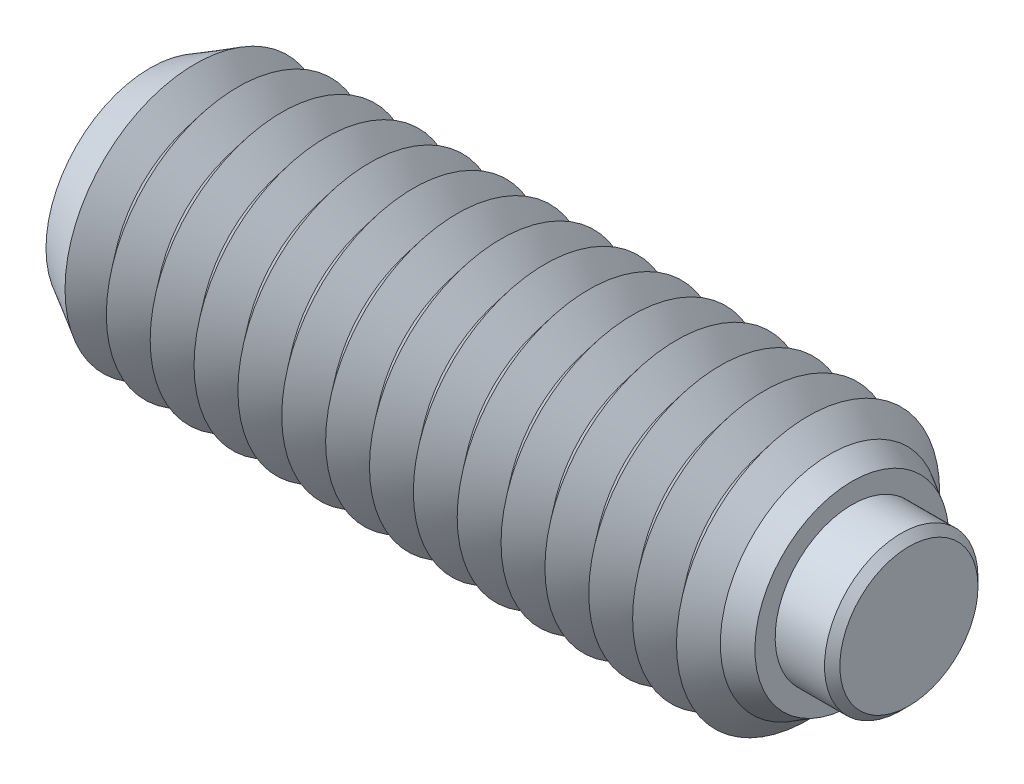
ISO-10303-21;
HEADER;
FILE_DESCRIPTION(('STEP AP214'),'2;1');
FILE_NAME('part.step','',(''),(''),'','','');
FILE_SCHEMA(('AUTOMOTIVE_DESIGN { 1 0 10303 214 1 1 1 1 }'));
ENDSEC;
DATA;
#1=APPLICATION_CONTEXT('core data for automotive mechanical design processes');
#2=APPLICATION_PROTOCOL_DEFINITION('international standard','automotive_design',2000,#1);
#3=PRODUCT_CONTEXT('',#1,'mechanical');
#4=PRODUCT('Part','Part','',(#3));
#5=PRODUCT_RELATED_PRODUCT_CATEGORY('part','',(#4));
#6=PRODUCT_DEFINITION_FORMATION('','',#4);
#7=PRODUCT_DEFINITION_CONTEXT('part definition',#1,'design');
#8=PRODUCT_DEFINITION('design','',#6,#7);
#9=PRODUCT_DEFINITION_SHAPE('','',#8);
#10=(LENGTH_UNIT() NAMED_UNIT(*) SI_UNIT(.MILLI.,.METRE.));
#11=(NAMED_UNIT(*) PLANE_ANGLE_UNIT() SI_UNIT($,.RADIAN.));
#12=(NAMED_UNIT(*) SI_UNIT($,.STERADIAN.) SOLID_ANGLE_UNIT());
#13=UNCERTAINTY_MEASURE_WITH_UNIT(LENGTH_MEASURE(1.E-05),#10,'distance_accuracy_value','');
#14=(GEOMETRIC_REPRESENTATION_CONTEXT(3) GLOBAL_UNCERTAINTY_ASSIGNED_CONTEXT((#13)) GLOBAL_UNIT_ASSIGNED_CONTEXT((#10,
#11,#12)) REPRESENTATION_CONTEXT('',''));
#15=CARTESIAN_POINT('',(0.,0.,0.));
#16=DIRECTION('',(0.,0.,1.));
#17=DIRECTION('',(1.,0.,0.));
#18=AXIS2_PLACEMENT_3D('',#15,#16,#17);
#19=CARTESIAN_POINT('',(1.8,0.,0.));
#20=DIRECTION('',(-1.,0.,0.));
#21=DIRECTION('',(0.,0.,1.));
#22=AXIS2_PLACEMENT_3D('',#19,#20,#21);
#23=CYLINDRICAL_SURFACE('',#22,1.75);
#24=CARTESIAN_POINT('',(1.625,0.,0.));
#25=DIRECTION('',(1.,0.,0.));
#26=DIRECTION('',(0.,0.,-1.));
#27=AXIS2_PLACEMENT_3D('',#24,#25,#26);
#28=CIRCLE('',#27,1.75);
#29=CARTESIAN_POINT('',(1.625,0.,-1.75));
#30=VERTEX_POINT('',#29);
#31=EDGE_CURVE('P0_E10',#30,#30,#28,.F.);
#32=ORIENTED_EDGE('',*,*,#31,.T.);
#33=EDGE_LOOP('',(#32));
#34=FACE_BOUND('',#33,.T.);
#35=CARTESIAN_POINT('',(-0.8,0.,0.));
#36=DIRECTION('',(1.,0.,0.));
#37=DIRECTION('',(0.,0.,-1.));
#38=AXIS2_PLACEMENT_3D('',#35,#36,#37);
#39=CIRCLE('',#38,1.75);
#40=CARTESIAN_POINT('',(-0.8,0.,-1.75));
#41=VERTEX_POINT('',#40);
#42=EDGE_CURVE('P0_E25',#41,#41,#39,.T.);
#43=ORIENTED_EDGE('',*,*,#42,.T.);
#44=EDGE_LOOP('',(#43));
#45=FACE_BOUND('',#44,.T.);
#46=ADVANCED_FACE('P0_F14',(#34,#45),#23,.T.);
#47=CARTESIAN_POINT('',(1.8,0.,0.));
#48=DIRECTION('',(1.,0.,0.));
#49=DIRECTION('',(0.,0.,-1.));
#50=AXIS2_PLACEMENT_3D('',#47,#48,#49);
#51=PLANE('',#50);
#52=CARTESIAN_POINT('',(1.8,0.,0.));
#53=DIRECTION('',(1.,0.,0.));
#54=DIRECTION('',(0.,0.,-1.));
#55=AXIS2_PLACEMENT_3D('',#52,#53,#54);
#56=CIRCLE('',#55,1.575);
#57=CARTESIAN_POINT('',(1.8,0.,-1.575));
#58=VERTEX_POINT('',#57);
#59=EDGE_CURVE('P0_E21',#58,#58,#56,.T.);
#60=ORIENTED_EDGE('',*,*,#59,.T.);
#61=EDGE_LOOP('',(#60));
#62=FACE_BOUND('',#61,.T.);
#63=ADVANCED_FACE('P0_F35',(#62),#51,.T.);
#64=CARTESIAN_POINT('',(-0.8,0.,0.));
#65=DIRECTION('',(1.,0.,0.));
#66=DIRECTION('',(0.,0.,-1.));
#67=AXIS2_PLACEMENT_3D('',#64,#65,#66);
#68=PLANE('',#67);
#69=ORIENTED_EDGE('',*,*,#42,.F.);
#70=EDGE_LOOP('',(#69));
#71=FACE_BOUND('',#70,.T.);
#72=ADVANCED_FACE('P0_F33',(#71),#68,.F.);
#73=CARTESIAN_POINT('',(1.8,0.,0.));
#74=DIRECTION('',(-1.,0.,0.));
#75=DIRECTION('',(0.,0.,1.));
#76=AXIS2_PLACEMENT_3D('',#73,#74,#75);
#77=CONICAL_SURFACE('',#76,1.575,0.785398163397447);
#78=ORIENTED_EDGE('',*,*,#31,.F.);
#79=EDGE_LOOP('',(#78));
#80=FACE_BOUND('',#79,.T.);
#81=ORIENTED_EDGE('',*,*,#59,.F.);
#82=EDGE_LOOP('',(#81));
#83=FACE_BOUND('',#82,.T.);
#84=ADVANCED_FACE('P0_F16',(#80,#83),#77,.T.);
#85=CLOSED_SHELL('',(#46,#63,#72,#84));
#86=MANIFOLD_SOLID_BREP('P0_B1',#85);
#87=CARTESIAN_POINT('',(-14.5,0.,0.));
#88=DIRECTION('',(-1.,0.,0.));
#89=DIRECTION('',(0.,0.,1.));
#90=AXIS2_PLACEMENT_3D('',#87,#88,#89);
#91=CONICAL_SURFACE('',#90,3.,0.895664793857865);
#92=CARTESIAN_POINT('',(-14.,0.,0.));
#93=DIRECTION('',(1.,0.,0.));
#94=DIRECTION('',(0.,0.,-1.));
#95=AXIS2_PLACEMENT_3D('',#92,#93,#94);
#96=CIRCLE('',#95,2.37550020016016);
#97=CARTESIAN_POINT('',(-14.,0.,-2.37550020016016));
#98=VERTEX_POINT('',#97);
#99=EDGE_CURVE('P1_E853',#98,#98,#96,.T.);
#100=ORIENTED_EDGE('',*,*,#99,.F.);
#101=EDGE_LOOP('',(#100));
#102=FACE_BOUND('',#101,.T.);
#103=CARTESIAN_POINT('',(-14.4741837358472,0.,0.));
#104=DIRECTION('',(1.,0.,0.));
#105=DIRECTION('',(0.,0.,-1.));
#106=AXIS2_PLACEMENT_3D('',#103,#104,#105);
#107=CIRCLE('',#106,2.96775549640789);
#108=CARTESIAN_POINT('',(-14.4741837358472,0.,-2.96775549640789));
#109=VERTEX_POINT('',#108);
#110=EDGE_CURVE('P1_E856',#109,#109,#107,.F.);
#111=ORIENTED_EDGE('',*,*,#110,.F.);
#112=EDGE_LOOP('',(#111));
#113=FACE_BOUND('',#112,.T.);
#114=ADVANCED_FACE('P1_F15',(#102,#113),#91,.T.);
#115=CARTESIAN_POINT('',(-1.,0.,0.));
#116=DIRECTION('',(1.,0.,0.));
#117=DIRECTION('',(0.,0.,-1.));
#118=AXIS2_PLACEMENT_3D('',#115,#116,#117);
#119=CONICAL_SURFACE('',#118,2.37550020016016,0.895664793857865);
#120=CARTESIAN_POINT('',(-0.5,0.,0.));
#121=DIRECTION('',(1.,0.,0.));
#122=DIRECTION('',(0.,0.,-1.));
#123=AXIS2_PLACEMENT_3D('',#120,#121,#122);
#124=CIRCLE('',#123,3.);
#125=CARTESIAN_POINT('',(-0.5,0.,-3.));
#126=VERTEX_POINT('',#125);
#127=EDGE_CURVE('P1_E771',#126,#126,#124,.T.);
#128=ORIENTED_EDGE('',*,*,#127,.F.);
#129=EDGE_LOOP('',(#128));
#130=FACE_BOUND('',#129,.T.);
#131=CARTESIAN_POINT('',(-1.,0.,0.));
#132=DIRECTION('',(1.,0.,0.));
#133=DIRECTION('',(0.,0.,-1.));
#134=AXIS2_PLACEMENT_3D('',#131,#132,#133);
#135=CIRCLE('',#134,2.37550020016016);
#136=CARTESIAN_POINT('',(-1.,0.,-2.37550020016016));
#137=VERTEX_POINT('',#136);
#138=EDGE_CURVE('P1_E772',#137,#137,#135,.T.);
#139=ORIENTED_EDGE('',*,*,#138,.T.);
#140=EDGE_LOOP('',(#139));
#141=FACE_BOUND('',#140,.T.);
#142=ADVANCED_FACE('P1_F222',(#130,#141),#119,.T.);
#143=CARTESIAN_POINT('',(-1.5,0.,0.));
#144=DIRECTION('',(-1.,0.,0.));
#145=DIRECTION('',(0.,0.,1.));
#146=AXIS2_PLACEMENT_3D('',#143,#144,#145);
#147=CONICAL_SURFACE('',#146,3.,0.895664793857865);
#148=ORIENTED_EDGE('',*,*,#138,.F.);
#149=EDGE_LOOP('',(#148));
#150=FACE_BOUND('',#149,.T.);
#151=CARTESIAN_POINT('',(-1.5,0.,0.));
#152=DIRECTION('',(1.,0.,0.));
#153=DIRECTION('',(0.,0.,-1.));
#154=AXIS2_PLACEMENT_3D('',#151,#152,#153);
#155=CIRCLE('',#154,3.);
#156=CARTESIAN_POINT('',(-1.5,0.,-3.));
#157=VERTEX_POINT('',#156);
#158=EDGE_CURVE('P1_E776',#157,#157,#155,.T.);
#159=ORIENTED_EDGE('',*,*,#158,.T.);
#160=EDGE_LOOP('',(#159));
#161=FACE_BOUND('',#160,.T.);
#162=ADVANCED_FACE('P1_F227',(#150,#161),#147,.T.);
#163=CARTESIAN_POINT('',(-0.8,0.,0.));
#164=DIRECTION('',(1.,0.,0.));
#165=DIRECTION('',(0.,1.,0.));
#166=AXIS2_PLACEMENT_3D('',#163,#164,#165);
#167=PLANE('',#166);
#168=CARTESIAN_POINT('',(-0.8,0.,0.));
#169=DIRECTION('',(1.,0.,0.));
#170=DIRECTION('',(0.,1.,0.));
#171=AXIS2_PLACEMENT_3D('',#168,#169,#170);
#172=CIRCLE('',#171,1.75);
#173=CARTESIAN_POINT('',(-0.8,1.75,0.));
#174=VERTEX_POINT('',#173);
#175=EDGE_CURVE('P1_E406',#174,#174,#172,.T.);
#176=ORIENTED_EDGE('',*,*,#175,.T.);
#177=EDGE_LOOP('',(#176));
#178=FACE_BOUND('',#177,.T.);
#179=ADVANCED_FACE('P1_F333',(#178),#167,.T.);
#180=CARTESIAN_POINT('',(-0.8,0.,0.));
#181=DIRECTION('',(1.,0.,0.));
#182=DIRECTION('',(0.,1.,0.));
#183=AXIS2_PLACEMENT_3D('',#180,#181,#182);
#184=CYLINDRICAL_SURFACE('',#183,1.75);
#185=ORIENTED_EDGE('',*,*,#175,.F.);
#186=EDGE_LOOP('',(#185));
#187=FACE_BOUND('',#186,.T.);
#188=CARTESIAN_POINT('',(0.5,0.,0.));
#189=DIRECTION('',(1.,0.,0.));
#190=DIRECTION('',(0.,1.,0.));
#191=AXIS2_PLACEMENT_3D('',#188,#189,#190);
#192=CIRCLE('',#191,1.75);
#193=CARTESIAN_POINT('',(0.5,1.75,0.));
#194=VERTEX_POINT('',#193);
#195=EDGE_CURVE('P1_E409',#194,#194,#192,.T.);
#196=ORIENTED_EDGE('',*,*,#195,.T.);
#197=EDGE_LOOP('',(#196));
#198=FACE_BOUND('',#197,.T.);
#199=ADVANCED_FACE('P1_F209',(#187,#198),#184,.F.);
#200=CARTESIAN_POINT('',(0.5,2.21132486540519,0.));
#201=DIRECTION('',(1.,0.,0.));
#202=DIRECTION('',(0.,1.,0.));
#203=AXIS2_PLACEMENT_3D('',#200,#201,#202);
#204=PLANE('',#203);
#205=ORIENTED_EDGE('',*,*,#195,.F.);
#206=EDGE_LOOP('',(#205));
#207=FACE_BOUND('',#206,.T.);
#208=CARTESIAN_POINT('',(0.5,0.,0.));
#209=DIRECTION('',(1.,0.,0.));
#210=DIRECTION('',(0.,1.,0.));
#211=AXIS2_PLACEMENT_3D('',#208,#209,#210);
#212=CIRCLE('',#211,2.21132486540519);
#213=CARTESIAN_POINT('',(0.5,2.21132486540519,0.));
#214=VERTEX_POINT('',#213);
#215=EDGE_CURVE('P1_E121',#214,#214,#212,.T.);
#216=ORIENTED_EDGE('',*,*,#215,.T.);
#217=EDGE_LOOP('',(#216));
#218=FACE_BOUND('',#217,.T.);
#219=ADVANCED_FACE('P1_F206',(#207,#218),#204,.T.);
#220=CARTESIAN_POINT('',(0.5,0.,0.));
#221=DIRECTION('',(-1.,0.,0.));
#222=DIRECTION('',(0.,-1.,0.));
#223=AXIS2_PLACEMENT_3D('',#220,#221,#222);
#224=CONICAL_SURFACE('',#223,2.21132486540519,0.523598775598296);
#225=CARTESIAN_POINT('',(0.,0.,0.));
#226=DIRECTION('',(1.,0.,0.));
#227=DIRECTION('',(0.,0.,-1.));
#228=AXIS2_PLACEMENT_3D('',#225,#226,#227);
#229=CIRCLE('',#228,2.5);
#230=CARTESIAN_POINT('',(0.,0.,-2.5));
#231=VERTEX_POINT('',#230);
#232=EDGE_CURVE('P1_E397',#231,#231,#229,.T.);
#233=ORIENTED_EDGE('',*,*,#232,.T.);
#234=EDGE_LOOP('',(#233));
#235=FACE_BOUND('',#234,.T.);
#236=ORIENTED_EDGE('',*,*,#215,.F.);
#237=EDGE_LOOP('',(#236));
#238=FACE_BOUND('',#237,.T.);
#239=ADVANCED_FACE('P1_F203',(#235,#238),#224,.T.);
#240=CARTESIAN_POINT('',(0.,0.,0.));
#241=DIRECTION('',(-1.,0.,0.));
#242=DIRECTION('',(0.,0.,1.));
#243=AXIS2_PLACEMENT_3D('',#240,#241,#242);
#244=CONICAL_SURFACE('',#243,2.5,0.785398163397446);
#245=ORIENTED_EDGE('',*,*,#127,.T.);
#246=EDGE_LOOP('',(#245));
#247=FACE_BOUND('',#246,.T.);
#248=ORIENTED_EDGE('',*,*,#232,.F.);
#249=EDGE_LOOP('',(#248));
#250=FACE_BOUND('',#249,.T.);
#251=ADVANCED_FACE('P1_F17',(#247,#250),#244,.T.);
#252=CARTESIAN_POINT('',(-2.,0.,0.));
#253=DIRECTION('',(1.,0.,0.));
#254=DIRECTION('',(0.,0.,-1.));
#255=AXIS2_PLACEMENT_3D('',#252,#253,#254);
#256=CONICAL_SURFACE('',#255,2.37550020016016,0.895664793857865);
#257=ORIENTED_EDGE('',*,*,#158,.F.);
#258=EDGE_LOOP('',(#257));
#259=FACE_BOUND('',#258,.T.);
#260=CARTESIAN_POINT('',(-2.,0.,0.));
#261=DIRECTION('',(1.,0.,0.));
#262=DIRECTION('',(0.,0.,-1.));
#263=AXIS2_PLACEMENT_3D('',#260,#261,#262);
#264=CIRCLE('',#263,2.37550020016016);
#265=CARTESIAN_POINT('',(-2.,0.,-2.37550020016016));
#266=VERTEX_POINT('',#265);
#267=EDGE_CURVE('P1_E781',#266,#266,#264,.T.);
#268=ORIENTED_EDGE('',*,*,#267,.T.);
#269=EDGE_LOOP('',(#268));
#270=FACE_BOUND('',#269,.T.);
#271=ADVANCED_FACE('P1_F327',(#259,#270),#256,.T.);
#272=CARTESIAN_POINT('',(-2.5,0.,0.));
#273=DIRECTION('',(-1.,0.,0.));
#274=DIRECTION('',(0.,0.,1.));
#275=AXIS2_PLACEMENT_3D('',#272,#273,#274);
#276=CONICAL_SURFACE('',#275,3.,0.895664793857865);
#277=ORIENTED_EDGE('',*,*,#267,.F.);
#278=EDGE_LOOP('',(#277));
#279=FACE_BOUND('',#278,.T.);
#280=CARTESIAN_POINT('',(-2.5,0.,0.));
#281=DIRECTION('',(1.,0.,0.));
#282=DIRECTION('',(0.,0.,-1.));
#283=AXIS2_PLACEMENT_3D('',#280,#281,#282);
#284=CIRCLE('',#283,3.);
#285=CARTESIAN_POINT('',(-2.5,0.,-3.));
#286=VERTEX_POINT('',#285);
#287=EDGE_CURVE('P1_E784',#286,#286,#284,.T.);
#288=ORIENTED_EDGE('',*,*,#287,.T.);
#289=EDGE_LOOP('',(#288));
#290=FACE_BOUND('',#289,.T.);
#291=ADVANCED_FACE('P1_F323',(#279,#290),#276,.T.);
#292=CARTESIAN_POINT('',(-3.,0.,0.));
#293=DIRECTION('',(1.,0.,0.));
#294=DIRECTION('',(0.,0.,-1.));
#295=AXIS2_PLACEMENT_3D('',#292,#293,#294);
#296=CONICAL_SURFACE('',#295,2.37550020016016,0.895664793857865);
#297=ORIENTED_EDGE('',*,*,#287,.F.);
#298=EDGE_LOOP('',(#297));
#299=FACE_BOUND('',#298,.T.);
#300=CARTESIAN_POINT('',(-3.,0.,0.));
#301=DIRECTION('',(1.,0.,0.));
#302=DIRECTION('',(0.,0.,-1.));
#303=AXIS2_PLACEMENT_3D('',#300,#301,#302);
#304=CIRCLE('',#303,2.37550020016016);
#305=CARTESIAN_POINT('',(-3.,0.,-2.37550020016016));
#306=VERTEX_POINT('',#305);
#307=EDGE_CURVE('P1_E787',#306,#306,#304,.T.);
#308=ORIENTED_EDGE('',*,*,#307,.T.);
#309=EDGE_LOOP('',(#308));
#310=FACE_BOUND('',#309,.T.);
#311=ADVANCED_FACE('P1_F319',(#299,#310),#296,.T.);
#312=CARTESIAN_POINT('',(-3.5,0.,0.));
#313=DIRECTION('',(-1.,0.,0.));
#314=DIRECTION('',(0.,0.,1.));
#315=AXIS2_PLACEMENT_3D('',#312,#313,#314);
#316=CONICAL_SURFACE('',#315,3.,0.895664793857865);
#317=ORIENTED_EDGE('',*,*,#307,.F.);
#318=EDGE_LOOP('',(#317));
#319=FACE_BOUND('',#318,.T.);
#320=CARTESIAN_POINT('',(-3.5,0.,0.));
#321=DIRECTION('',(1.,0.,0.));
#322=DIRECTION('',(0.,0.,-1.));
#323=AXIS2_PLACEMENT_3D('',#320,#321,#322);
#324=CIRCLE('',#323,3.);
#325=CARTESIAN_POINT('',(-3.5,0.,-3.));
#326=VERTEX_POINT('',#325);
#327=EDGE_CURVE('P1_E790',#326,#326,#324,.T.);
#328=ORIENTED_EDGE('',*,*,#327,.T.);
#329=EDGE_LOOP('',(#328));
#330=FACE_BOUND('',#329,.T.);
#331=ADVANCED_FACE('P1_F315',(#319,#330),#316,.T.);
#332=CARTESIAN_POINT('',(-4.,0.,0.));
#333=DIRECTION('',(1.,0.,0.));
#334=DIRECTION('',(0.,0.,-1.));
#335=AXIS2_PLACEMENT_3D('',#332,#333,#334);
#336=CONICAL_SURFACE('',#335,2.37550020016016,0.895664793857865);
#337=ORIENTED_EDGE('',*,*,#327,.F.);
#338=EDGE_LOOP('',(#337));
#339=FACE_BOUND('',#338,.T.);
#340=CARTESIAN_POINT('',(-4.,0.,0.));
#341=DIRECTION('',(1.,0.,0.));
#342=DIRECTION('',(0.,0.,-1.));
#343=AXIS2_PLACEMENT_3D('',#340,#341,#342);
#344=CIRCLE('',#343,2.37550020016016);
#345=CARTESIAN_POINT('',(-4.,0.,-2.37550020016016));
#346=VERTEX_POINT('',#345);
#347=EDGE_CURVE('P1_E793',#346,#346,#344,.T.);
#348=ORIENTED_EDGE('',*,*,#347,.T.);
#349=EDGE_LOOP('',(#348));
#350=FACE_BOUND('',#349,.T.);
#351=ADVANCED_FACE('P1_F311',(#339,#350),#336,.T.);
#352=CARTESIAN_POINT('',(-4.5,0.,0.));
#353=DIRECTION('',(-1.,0.,0.));
#354=DIRECTION('',(0.,0.,1.));
#355=AXIS2_PLACEMENT_3D('',#352,#353,#354);
#356=CONICAL_SURFACE('',#355,3.,0.895664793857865);
#357=ORIENTED_EDGE('',*,*,#347,.F.);
#358=EDGE_LOOP('',(#357));
#359=FACE_BOUND('',#358,.T.);
#360=CARTESIAN_POINT('',(-4.5,0.,0.));
#361=DIRECTION('',(1.,0.,0.));
#362=DIRECTION('',(0.,0.,-1.));
#363=AXIS2_PLACEMENT_3D('',#360,#361,#362);
#364=CIRCLE('',#363,3.);
#365=CARTESIAN_POINT('',(-4.5,0.,-3.));
#366=VERTEX_POINT('',#365);
#367=EDGE_CURVE('P1_E796',#366,#366,#364,.T.);
#368=ORIENTED_EDGE('',*,*,#367,.T.);
#369=EDGE_LOOP('',(#368));
#370=FACE_BOUND('',#369,.T.);
#371=ADVANCED_FACE('P1_F307',(#359,#370),#356,.T.);
#372=CARTESIAN_POINT('',(-5.,0.,0.));
#373=DIRECTION('',(1.,0.,0.));
#374=DIRECTION('',(0.,0.,-1.));
#375=AXIS2_PLACEMENT_3D('',#372,#373,#374);
#376=CONICAL_SURFACE('',#375,2.37550020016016,0.895664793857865);
#377=ORIENTED_EDGE('',*,*,#367,.F.);
#378=EDGE_LOOP('',(#377));
#379=FACE_BOUND('',#378,.T.);
#380=CARTESIAN_POINT('',(-5.,0.,0.));
#381=DIRECTION('',(1.,0.,0.));
#382=DIRECTION('',(0.,0.,-1.));
#383=AXIS2_PLACEMENT_3D('',#380,#381,#382);
#384=CIRCLE('',#383,2.37550020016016);
#385=CARTESIAN_POINT('',(-5.,0.,-2.37550020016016));
#386=VERTEX_POINT('',#385);
#387=EDGE_CURVE('P1_E799',#386,#386,#384,.T.);
#388=ORIENTED_EDGE('',*,*,#387,.T.);
#389=EDGE_LOOP('',(#388));
#390=FACE_BOUND('',#389,.T.);
#391=ADVANCED_FACE('P1_F303',(#379,#390),#376,.T.);
#392=CARTESIAN_POINT('',(-5.5,0.,0.));
#393=DIRECTION('',(-1.,0.,0.));
#394=DIRECTION('',(0.,0.,1.));
#395=AXIS2_PLACEMENT_3D('',#392,#393,#394);
#396=CONICAL_SURFACE('',#395,3.,0.895664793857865);
#397=ORIENTED_EDGE('',*,*,#387,.F.);
#398=EDGE_LOOP('',(#397));
#399=FACE_BOUND('',#398,.T.);
#400=CARTESIAN_POINT('',(-5.5,0.,0.));
#401=DIRECTION('',(1.,0.,0.));
#402=DIRECTION('',(0.,0.,-1.));
#403=AXIS2_PLACEMENT_3D('',#400,#401,#402);
#404=CIRCLE('',#403,3.);
#405=CARTESIAN_POINT('',(-5.5,0.,-3.));
#406=VERTEX_POINT('',#405);
#407=EDGE_CURVE('P1_E802',#406,#406,#404,.T.);
#408=ORIENTED_EDGE('',*,*,#407,.T.);
#409=EDGE_LOOP('',(#408));
#410=FACE_BOUND('',#409,.T.);
#411=ADVANCED_FACE('P1_F299',(#399,#410),#396,.T.);
#412=CARTESIAN_POINT('',(-6.,0.,0.));
#413=DIRECTION('',(1.,0.,0.));
#414=DIRECTION('',(0.,0.,-1.));
#415=AXIS2_PLACEMENT_3D('',#412,#413,#414);
#416=CONICAL_SURFACE('',#415,2.37550020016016,0.895664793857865);
#417=ORIENTED_EDGE('',*,*,#407,.F.);
#418=EDGE_LOOP('',(#417));
#419=FACE_BOUND('',#418,.T.);
#420=CARTESIAN_POINT('',(-6.,0.,0.));
#421=DIRECTION('',(1.,0.,0.));
#422=DIRECTION('',(0.,0.,-1.));
#423=AXIS2_PLACEMENT_3D('',#420,#421,#422);
#424=CIRCLE('',#423,2.37550020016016);
#425=CARTESIAN_POINT('',(-6.,0.,-2.37550020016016));
#426=VERTEX_POINT('',#425);
#427=EDGE_CURVE('P1_E805',#426,#426,#424,.T.);
#428=ORIENTED_EDGE('',*,*,#427,.T.);
#429=EDGE_LOOP('',(#428));
#430=FACE_BOUND('',#429,.T.);
#431=ADVANCED_FACE('P1_F295',(#419,#430),#416,.T.);
#432=CARTESIAN_POINT('',(-6.5,0.,0.));
#433=DIRECTION('',(-1.,0.,0.));
#434=DIRECTION('',(0.,0.,1.));
#435=AXIS2_PLACEMENT_3D('',#432,#433,#434);
#436=CONICAL_SURFACE('',#435,3.,0.895664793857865);
#437=ORIENTED_EDGE('',*,*,#427,.F.);
#438=EDGE_LOOP('',(#437));
#439=FACE_BOUND('',#438,.T.);
#440=CARTESIAN_POINT('',(-6.5,0.,0.));
#441=DIRECTION('',(1.,0.,0.));
#442=DIRECTION('',(0.,0.,-1.));
#443=AXIS2_PLACEMENT_3D('',#440,#441,#442);
#444=CIRCLE('',#443,3.);
#445=CARTESIAN_POINT('',(-6.5,0.,-3.));
#446=VERTEX_POINT('',#445);
#447=EDGE_CURVE('P1_E808',#446,#446,#444,.T.);
#448=ORIENTED_EDGE('',*,*,#447,.T.);
#449=EDGE_LOOP('',(#448));
#450=FACE_BOUND('',#449,.T.);
#451=ADVANCED_FACE('P1_F291',(#439,#450),#436,.T.);
#452=CARTESIAN_POINT('',(-7.,0.,0.));
#453=DIRECTION('',(1.,0.,0.));
#454=DIRECTION('',(0.,0.,-1.));
#455=AXIS2_PLACEMENT_3D('',#452,#453,#454);
#456=CONICAL_SURFACE('',#455,2.37550020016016,0.895664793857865);
#457=ORIENTED_EDGE('',*,*,#447,.F.);
#458=EDGE_LOOP('',(#457));
#459=FACE_BOUND('',#458,.T.);
#460=CARTESIAN_POINT('',(-7.,0.,0.));
#461=DIRECTION('',(1.,0.,0.));
#462=DIRECTION('',(0.,0.,-1.));
#463=AXIS2_PLACEMENT_3D('',#460,#461,#462);
#464=CIRCLE('',#463,2.37550020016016);
#465=CARTESIAN_POINT('',(-7.,0.,-2.37550020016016));
#466=VERTEX_POINT('',#465);
#467=EDGE_CURVE('P1_E811',#466,#466,#464,.T.);
#468=ORIENTED_EDGE('',*,*,#467,.T.);
#469=EDGE_LOOP('',(#468));
#470=FACE_BOUND('',#469,.T.);
#471=ADVANCED_FACE('P1_F287',(#459,#470),#456,.T.);
#472=CARTESIAN_POINT('',(-7.5,0.,0.));
#473=DIRECTION('',(-1.,0.,0.));
#474=DIRECTION('',(0.,0.,1.));
#475=AXIS2_PLACEMENT_3D('',#472,#473,#474);
#476=CONICAL_SURFACE('',#475,3.,0.895664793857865);
#477=ORIENTED_EDGE('',*,*,#467,.F.);
#478=EDGE_LOOP('',(#477));
#479=FACE_BOUND('',#478,.T.);
#480=CARTESIAN_POINT('',(-7.5,0.,0.));
#481=DIRECTION('',(1.,0.,0.));
#482=DIRECTION('',(0.,0.,-1.));
#483=AXIS2_PLACEMENT_3D('',#480,#481,#482);
#484=CIRCLE('',#483,3.);
#485=CARTESIAN_POINT('',(-7.5,0.,-3.));
#486=VERTEX_POINT('',#485);
#487=EDGE_CURVE('P1_E814',#486,#486,#484,.T.);
#488=ORIENTED_EDGE('',*,*,#487,.T.);
#489=EDGE_LOOP('',(#488));
#490=FACE_BOUND('',#489,.T.);
#491=ADVANCED_FACE('P1_F283',(#479,#490),#476,.T.);
#492=CARTESIAN_POINT('',(-8.,0.,0.));
#493=DIRECTION('',(1.,0.,0.));
#494=DIRECTION('',(0.,0.,-1.));
#495=AXIS2_PLACEMENT_3D('',#492,#493,#494);
#496=CONICAL_SURFACE('',#495,2.37550020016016,0.895664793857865);
#497=ORIENTED_EDGE('',*,*,#487,.F.);
#498=EDGE_LOOP('',(#497));
#499=FACE_BOUND('',#498,.T.);
#500=CARTESIAN_POINT('',(-8.,0.,0.));
#501=DIRECTION('',(1.,0.,0.));
#502=DIRECTION('',(0.,0.,-1.));
#503=AXIS2_PLACEMENT_3D('',#500,#501,#502);
#504=CIRCLE('',#503,2.37550020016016);
#505=CARTESIAN_POINT('',(-8.,0.,-2.37550020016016));
#506=VERTEX_POINT('',#505);
#507=EDGE_CURVE('P1_E817',#506,#506,#504,.T.);
#508=ORIENTED_EDGE('',*,*,#507,.T.);
#509=EDGE_LOOP('',(#508));
#510=FACE_BOUND('',#509,.T.);
#511=ADVANCED_FACE('P1_F279',(#499,#510),#496,.T.);
#512=CARTESIAN_POINT('',(-8.5,0.,0.));
#513=DIRECTION('',(-1.,0.,0.));
#514=DIRECTION('',(0.,0.,1.));
#515=AXIS2_PLACEMENT_3D('',#512,#513,#514);
#516=CONICAL_SURFACE('',#515,3.,0.895664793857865);
#517=ORIENTED_EDGE('',*,*,#507,.F.);
#518=EDGE_LOOP('',(#517));
#519=FACE_BOUND('',#518,.T.);
#520=CARTESIAN_POINT('',(-8.5,0.,0.));
#521=DIRECTION('',(1.,0.,0.));
#522=DIRECTION('',(0.,0.,-1.));
#523=AXIS2_PLACEMENT_3D('',#520,#521,#522);
#524=CIRCLE('',#523,3.);
#525=CARTESIAN_POINT('',(-8.5,0.,-3.));
#526=VERTEX_POINT('',#525);
#527=EDGE_CURVE('P1_E820',#526,#526,#524,.T.);
#528=ORIENTED_EDGE('',*,*,#527,.T.);
#529=EDGE_LOOP('',(#528));
#530=FACE_BOUND('',#529,.T.);
#531=ADVANCED_FACE('P1_F275',(#519,#530),#516,.T.);
#532=CARTESIAN_POINT('',(-9.,0.,0.));
#533=DIRECTION('',(1.,0.,0.));
#534=DIRECTION('',(0.,0.,-1.));
#535=AXIS2_PLACEMENT_3D('',#532,#533,#534);
#536=CONICAL_SURFACE('',#535,2.37550020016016,0.895664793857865);
#537=ORIENTED_EDGE('',*,*,#527,.F.);
#538=EDGE_LOOP('',(#537));
#539=FACE_BOUND('',#538,.T.);
#540=CARTESIAN_POINT('',(-9.,0.,0.));
#541=DIRECTION('',(1.,0.,0.));
#542=DIRECTION('',(0.,0.,-1.));
#543=AXIS2_PLACEMENT_3D('',#540,#541,#542);
#544=CIRCLE('',#543,2.37550020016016);
#545=CARTESIAN_POINT('',(-9.,0.,-2.37550020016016));
#546=VERTEX_POINT('',#545);
#547=EDGE_CURVE('P1_E823',#546,#546,#544,.T.);
#548=ORIENTED_EDGE('',*,*,#547,.T.);
#549=EDGE_LOOP('',(#548));
#550=FACE_BOUND('',#549,.T.);
#551=ADVANCED_FACE('P1_F271',(#539,#550),#536,.T.);
#552=CARTESIAN_POINT('',(-9.5,0.,0.));
#553=DIRECTION('',(-1.,0.,0.));
#554=DIRECTION('',(0.,0.,1.));
#555=AXIS2_PLACEMENT_3D('',#552,#553,#554);
#556=CONICAL_SURFACE('',#555,3.,0.895664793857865);
#557=ORIENTED_EDGE('',*,*,#547,.F.);
#558=EDGE_LOOP('',(#557));
#559=FACE_BOUND('',#558,.T.);
#560=CARTESIAN_POINT('',(-9.5,0.,0.));
#561=DIRECTION('',(1.,0.,0.));
#562=DIRECTION('',(0.,0.,-1.));
#563=AXIS2_PLACEMENT_3D('',#560,#561,#562);
#564=CIRCLE('',#563,3.);
#565=CARTESIAN_POINT('',(-9.5,0.,-3.));
#566=VERTEX_POINT('',#565);
#567=EDGE_CURVE('P1_E826',#566,#566,#564,.T.);
#568=ORIENTED_EDGE('',*,*,#567,.T.);
#569=EDGE_LOOP('',(#568));
#570=FACE_BOUND('',#569,.T.);
#571=ADVANCED_FACE('P1_F267',(#559,#570),#556,.T.);
#572=CARTESIAN_POINT('',(-10.,0.,0.));
#573=DIRECTION('',(1.,0.,0.));
#574=DIRECTION('',(0.,0.,-1.));
#575=AXIS2_PLACEMENT_3D('',#572,#573,#574);
#576=CONICAL_SURFACE('',#575,2.37550020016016,0.895664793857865);
#577=ORIENTED_EDGE('',*,*,#567,.F.);
#578=EDGE_LOOP('',(#577));
#579=FACE_BOUND('',#578,.T.);
#580=CARTESIAN_POINT('',(-10.,0.,0.));
#581=DIRECTION('',(1.,0.,0.));
#582=DIRECTION('',(0.,0.,-1.));
#583=AXIS2_PLACEMENT_3D('',#580,#581,#582);
#584=CIRCLE('',#583,2.37550020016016);
#585=CARTESIAN_POINT('',(-10.,0.,-2.37550020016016));
#586=VERTEX_POINT('',#585);
#587=EDGE_CURVE('P1_E829',#586,#586,#584,.T.);
#588=ORIENTED_EDGE('',*,*,#587,.T.);
#589=EDGE_LOOP('',(#588));
#590=FACE_BOUND('',#589,.T.);
#591=ADVANCED_FACE('P1_F263',(#579,#590),#576,.T.);
#592=CARTESIAN_POINT('',(-10.5,0.,0.));
#593=DIRECTION('',(-1.,0.,0.));
#594=DIRECTION('',(0.,0.,1.));
#595=AXIS2_PLACEMENT_3D('',#592,#593,#594);
#596=CONICAL_SURFACE('',#595,3.,0.895664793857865);
#597=ORIENTED_EDGE('',*,*,#587,.F.);
#598=EDGE_LOOP('',(#597));
#599=FACE_BOUND('',#598,.T.);
#600=CARTESIAN_POINT('',(-10.5,0.,0.));
#601=DIRECTION('',(1.,0.,0.));
#602=DIRECTION('',(0.,0.,-1.));
#603=AXIS2_PLACEMENT_3D('',#600,#601,#602);
#604=CIRCLE('',#603,3.);
#605=CARTESIAN_POINT('',(-10.5,0.,-3.));
#606=VERTEX_POINT('',#605);
#607=EDGE_CURVE('P1_E832',#606,#606,#604,.T.);
#608=ORIENTED_EDGE('',*,*,#607,.T.);
#609=EDGE_LOOP('',(#608));
#610=FACE_BOUND('',#609,.T.);
#611=ADVANCED_FACE('P1_F259',(#599,#610),#596,.T.);
#612=CARTESIAN_POINT('',(-11.,0.,0.));
#613=DIRECTION('',(1.,0.,0.));
#614=DIRECTION('',(0.,0.,-1.));
#615=AXIS2_PLACEMENT_3D('',#612,#613,#614);
#616=CONICAL_SURFACE('',#615,2.37550020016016,0.895664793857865);
#617=ORIENTED_EDGE('',*,*,#607,.F.);
#618=EDGE_LOOP('',(#617));
#619=FACE_BOUND('',#618,.T.);
#620=CARTESIAN_POINT('',(-11.,0.,0.));
#621=DIRECTION('',(1.,0.,0.));
#622=DIRECTION('',(0.,0.,-1.));
#623=AXIS2_PLACEMENT_3D('',#620,#621,#622);
#624=CIRCLE('',#623,2.37550020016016);
#625=CARTESIAN_POINT('',(-11.,0.,-2.37550020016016));
#626=VERTEX_POINT('',#625);
#627=EDGE_CURVE('P1_E835',#626,#626,#624,.T.);
#628=ORIENTED_EDGE('',*,*,#627,.T.);
#629=EDGE_LOOP('',(#628));
#630=FACE_BOUND('',#629,.T.);
#631=ADVANCED_FACE('P1_F255',(#619,#630),#616,.T.);
#632=CARTESIAN_POINT('',(-11.5,0.,0.));
#633=DIRECTION('',(-1.,0.,0.));
#634=DIRECTION('',(0.,0.,1.));
#635=AXIS2_PLACEMENT_3D('',#632,#633,#634);
#636=CONICAL_SURFACE('',#635,3.,0.895664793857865);
#637=ORIENTED_EDGE('',*,*,#627,.F.);
#638=EDGE_LOOP('',(#637));
#639=FACE_BOUND('',#638,.T.);
#640=CARTESIAN_POINT('',(-11.5,0.,0.));
#641=DIRECTION('',(1.,0.,0.));
#642=DIRECTION('',(0.,0.,-1.));
#643=AXIS2_PLACEMENT_3D('',#640,#641,#642);
#644=CIRCLE('',#643,3.);
#645=CARTESIAN_POINT('',(-11.5,0.,-3.));
#646=VERTEX_POINT('',#645);
#647=EDGE_CURVE('P1_E838',#646,#646,#644,.T.);
#648=ORIENTED_EDGE('',*,*,#647,.T.);
#649=EDGE_LOOP('',(#648));
#650=FACE_BOUND('',#649,.T.);
#651=ADVANCED_FACE('P1_F251',(#639,#650),#636,.T.);
#652=CARTESIAN_POINT('',(-12.,0.,0.));
#653=DIRECTION('',(1.,0.,0.));
#654=DIRECTION('',(0.,0.,-1.));
#655=AXIS2_PLACEMENT_3D('',#652,#653,#654);
#656=CONICAL_SURFACE('',#655,2.37550020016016,0.895664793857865);
#657=ORIENTED_EDGE('',*,*,#647,.F.);
#658=EDGE_LOOP('',(#657));
#659=FACE_BOUND('',#658,.T.);
#660=CARTESIAN_POINT('',(-12.,0.,0.));
#661=DIRECTION('',(1.,0.,0.));
#662=DIRECTION('',(0.,0.,-1.));
#663=AXIS2_PLACEMENT_3D('',#660,#661,#662);
#664=CIRCLE('',#663,2.37550020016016);
#665=CARTESIAN_POINT('',(-12.,0.,-2.37550020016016));
#666=VERTEX_POINT('',#665);
#667=EDGE_CURVE('P1_E841',#666,#666,#664,.T.);
#668=ORIENTED_EDGE('',*,*,#667,.T.);
#669=EDGE_LOOP('',(#668));
#670=FACE_BOUND('',#669,.T.);
#671=ADVANCED_FACE('P1_F247',(#659,#670),#656,.T.);
#672=CARTESIAN_POINT('',(-12.5,0.,0.));
#673=DIRECTION('',(-1.,0.,0.));
#674=DIRECTION('',(0.,0.,1.));
#675=AXIS2_PLACEMENT_3D('',#672,#673,#674);
#676=CONICAL_SURFACE('',#675,3.,0.895664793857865);
#677=ORIENTED_EDGE('',*,*,#667,.F.);
#678=EDGE_LOOP('',(#677));
#679=FACE_BOUND('',#678,.T.);
#680=CARTESIAN_POINT('',(-12.5,0.,0.));
#681=DIRECTION('',(1.,0.,0.));
#682=DIRECTION('',(0.,0.,-1.));
#683=AXIS2_PLACEMENT_3D('',#680,#681,#682);
#684=CIRCLE('',#683,3.);
#685=CARTESIAN_POINT('',(-12.5,0.,-3.));
#686=VERTEX_POINT('',#685);
#687=EDGE_CURVE('P1_E844',#686,#686,#684,.T.);
#688=ORIENTED_EDGE('',*,*,#687,.T.);
#689=EDGE_LOOP('',(#688));
#690=FACE_BOUND('',#689,.T.);
#691=ADVANCED_FACE('P1_F243',(#679,#690),#676,.T.);
#692=CARTESIAN_POINT('',(-13.,0.,0.));
#693=DIRECTION('',(1.,0.,0.));
#694=DIRECTION('',(0.,0.,-1.));
#695=AXIS2_PLACEMENT_3D('',#692,#693,#694);
#696=CONICAL_SURFACE('',#695,2.37550020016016,0.895664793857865);
#697=ORIENTED_EDGE('',*,*,#687,.F.);
#698=EDGE_LOOP('',(#697));
#699=FACE_BOUND('',#698,.T.);
#700=CARTESIAN_POINT('',(-13.,0.,0.));
#701=DIRECTION('',(1.,0.,0.));
#702=DIRECTION('',(0.,0.,-1.));
#703=AXIS2_PLACEMENT_3D('',#700,#701,#702);
#704=CIRCLE('',#703,2.37550020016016);
#705=CARTESIAN_POINT('',(-13.,0.,-2.37550020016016));
#706=VERTEX_POINT('',#705);
#707=EDGE_CURVE('P1_E847',#706,#706,#704,.T.);
#708=ORIENTED_EDGE('',*,*,#707,.T.);
#709=EDGE_LOOP('',(#708));
#710=FACE_BOUND('',#709,.T.);
#711=ADVANCED_FACE('P1_F239',(#699,#710),#696,.T.);
#712=CARTESIAN_POINT('',(-13.5,0.,0.));
#713=DIRECTION('',(-1.,0.,0.));
#714=DIRECTION('',(0.,0.,1.));
#715=AXIS2_PLACEMENT_3D('',#712,#713,#714);
#716=CONICAL_SURFACE('',#715,3.,0.895664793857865);
#717=ORIENTED_EDGE('',*,*,#707,.F.);
#718=EDGE_LOOP('',(#717));
#719=FACE_BOUND('',#718,.T.);
#720=CARTESIAN_POINT('',(-13.5,0.,0.));
#721=DIRECTION('',(1.,0.,0.));
#722=DIRECTION('',(0.,0.,-1.));
#723=AXIS2_PLACEMENT_3D('',#720,#721,#722);
#724=CIRCLE('',#723,3.);
#725=CARTESIAN_POINT('',(-13.5,0.,-3.));
#726=VERTEX_POINT('',#725);
#727=EDGE_CURVE('P1_E850',#726,#726,#724,.T.);
#728=ORIENTED_EDGE('',*,*,#727,.T.);
#729=EDGE_LOOP('',(#728));
#730=FACE_BOUND('',#729,.T.);
#731=ADVANCED_FACE('P1_F235',(#719,#730),#716,.T.);
#732=CARTESIAN_POINT('',(-14.,0.,0.));
#733=DIRECTION('',(1.,0.,0.));
#734=DIRECTION('',(0.,0.,-1.));
#735=AXIS2_PLACEMENT_3D('',#732,#733,#734);
#736=CONICAL_SURFACE('',#735,2.37550020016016,0.895664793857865);
#737=ORIENTED_EDGE('',*,*,#727,.F.);
#738=EDGE_LOOP('',(#737));
#739=FACE_BOUND('',#738,.T.);
#740=ORIENTED_EDGE('',*,*,#99,.T.);
#741=EDGE_LOOP('',(#740));
#742=FACE_BOUND('',#741,.T.);
#743=ADVANCED_FACE('P1_F219',(#739,#742),#736,.T.);
#744=CARTESIAN_POINT('',(-15.5,0.,0.));
#745=DIRECTION('',(1.,0.,0.));
#746=DIRECTION('',(0.,0.,1.));
#747=AXIS2_PLACEMENT_3D('',#744,#745,#746);
#748=CONICAL_SURFACE('',#747,2.37550020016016,0.5235987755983);
#749=CARTESIAN_POINT('',(-15.5,0.,0.));
#750=DIRECTION('',(-1.,0.,0.));
#751=DIRECTION('',(0.,0.,1.));
#752=AXIS2_PLACEMENT_3D('',#749,#750,#751);
#753=CIRCLE('',#752,2.37550020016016);
#754=CARTESIAN_POINT('',(-15.5,0.,2.37550020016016));
#755=VERTEX_POINT('',#754);
#756=EDGE_CURVE('P1_E858',#755,#755,#753,.T.);
#757=ORIENTED_EDGE('',*,*,#756,.F.);
#758=EDGE_LOOP('',(#757));
#759=FACE_BOUND('',#758,.T.);
#760=ORIENTED_EDGE('',*,*,#110,.T.);
#761=EDGE_LOOP('',(#760));
#762=FACE_BOUND('',#761,.T.);
#763=ADVANCED_FACE('P1_F159',(#759,#762),#748,.T.);
#764=CARTESIAN_POINT('',(-15.5,0.,0.));
#765=DIRECTION('',(1.,0.,0.));
#766=DIRECTION('',(0.,0.,-1.));
#767=AXIS2_PLACEMENT_3D('',#764,#765,#766);
#768=PLANE('',#767);
#769=CARTESIAN_POINT('',(-15.5,0.,0.));
#770=DIRECTION('',(1.,0.,0.));
#771=DIRECTION('',(0.,0.,-1.));
#772=AXIS2_PLACEMENT_3D('',#769,#770,#771);
#773=CIRCLE('',#772,1.73205080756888);
#774=CARTESIAN_POINT('',(-15.5,-1.5,-0.866025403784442));
#775=VERTEX_POINT('',#774);
#776=CARTESIAN_POINT('',(-15.5,0.,-1.73205080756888));
#777=VERTEX_POINT('',#776);
#778=EDGE_CURVE('P1_E19',#775,#777,#773,.T.);
#779=ORIENTED_EDGE('',*,*,#778,.T.);
#780=CARTESIAN_POINT('',(-15.5,1.5,-0.866025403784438));
#781=VERTEX_POINT('',#780);
#782=EDGE_CURVE('P1_E10',#777,#781,#773,.T.);
#783=ORIENTED_EDGE('',*,*,#782,.T.);
#784=CARTESIAN_POINT('',(-15.5,1.5,0.866025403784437));
#785=VERTEX_POINT('',#784);
#786=EDGE_CURVE('P1_E24',#781,#785,#773,.T.);
#787=ORIENTED_EDGE('',*,*,#786,.T.);
#788=CARTESIAN_POINT('',(-15.5,0.,0.));
#789=DIRECTION('',(-1.,0.,0.));
#790=DIRECTION('',(0.,0.,1.));
#791=AXIS2_PLACEMENT_3D('',#788,#789,#790);
#792=CIRCLE('',#791,1.73205080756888);
#793=CARTESIAN_POINT('',(-15.5,0.,1.73205080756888));
#794=VERTEX_POINT('',#793);
#795=EDGE_CURVE('P1_E92',#794,#785,#792,.T.);
#796=ORIENTED_EDGE('',*,*,#795,.F.);
#797=CARTESIAN_POINT('',(-15.5,-1.5,0.86602540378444));
#798=VERTEX_POINT('',#797);
#799=EDGE_CURVE('P1_E101',#794,#798,#773,.T.);
#800=ORIENTED_EDGE('',*,*,#799,.T.);
#801=EDGE_CURVE('P1_E107',#798,#775,#773,.T.);
#802=ORIENTED_EDGE('',*,*,#801,.T.);
#803=EDGE_LOOP('',(#779,#783,#787,#796,#800,#802));
#804=FACE_BOUND('',#803,.T.);
#805=ORIENTED_EDGE('',*,*,#756,.T.);
#806=EDGE_LOOP('',(#805));
#807=FACE_BOUND('',#806,.T.);
#808=ADVANCED_FACE('P1_F108',(#804,#807),#768,.F.);
#809=CARTESIAN_POINT('',(-15.5,0.,0.));
#810=DIRECTION('',(-1.,0.,0.));
#811=DIRECTION('',(0.,0.,1.));
#812=AXIS2_PLACEMENT_3D('',#809,#810,#811);
#813=CONICAL_SURFACE('',#812,1.73205080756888,1.0471975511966);
#814=ORIENTED_EDGE('',*,*,#778,.F.);
#815=CARTESIAN_POINT('',(-15.5000666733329,0.000199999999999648,-1.73216627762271));
#816=CARTESIAN_POINT('',(-15.4780828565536,-0.0657192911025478,-1.69410775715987));
#817=CARTESIAN_POINT('',(-15.4580888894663,-0.132207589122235,-1.65572072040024));
#818=CARTESIAN_POINT('',(-15.4231881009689,-0.26633566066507,-1.5782818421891));
#819=CARTESIAN_POINT('',(-15.4082936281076,-0.333977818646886,-1.53922862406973));
#820=CARTESIAN_POINT('',(-15.3851066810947,-0.468423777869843,-1.4616062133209));
#821=CARTESIAN_POINT('',(-15.3766599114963,-0.535206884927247,-1.42304896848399));
#822=CARTESIAN_POINT('',(-15.3665735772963,-0.66908756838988,-1.34575291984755));
#823=CARTESIAN_POINT('',(-15.3649256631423,-0.736184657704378,-1.30701439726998));
#824=CARTESIAN_POINT('',(-15.3683416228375,-0.861574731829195,-1.23462040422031));
#825=CARTESIAN_POINT('',(-15.3725667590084,-0.919886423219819,-1.20095413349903));
#826=CARTESIAN_POINT('',(-15.3859617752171,-1.03612987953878,-1.13384094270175));
#827=CARTESIAN_POINT('',(-15.3951362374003,-1.09406124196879,-1.10039425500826));
#828=CARTESIAN_POINT('',(-15.4180731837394,-1.21054465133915,-1.03314252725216));
#829=CARTESIAN_POINT('',(-15.4319329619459,-1.26908194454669,-0.99934600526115));
#830=CARTESIAN_POINT('',(-15.4633897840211,-1.38528312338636,-0.932257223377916));
#831=CARTESIAN_POINT('',(-15.4809794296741,-1.44294849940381,-0.89896410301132));
#832=CARTESIAN_POINT('',(-15.5000666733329,-1.5002,-0.8659099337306));
#833=B_SPLINE_CURVE_WITH_KNOTS('',3,(#815,#816,#817,#818,#819,#820,#821,#822,#823,#824,#825,
#826,#827,#828,#829,#830,#831,#832),.UNSPECIFIED.,.F.,.F.,(4,2,2,2,2,2,2,2,4),(0.,
0.237777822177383,0.476127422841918,0.708577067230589,0.940741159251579,1.1429435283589,
1.34533342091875,1.55221450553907,1.75868901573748),.UNSPECIFIED.);
#834=EDGE_CURVE('P1_E130',#777,#775,#833,.T.);
#835=ORIENTED_EDGE('',*,*,#834,.F.);
#836=EDGE_LOOP('',(#814,#835));
#837=FACE_BOUND('',#836,.T.);
#838=ADVANCED_FACE('P1_F158',(#837),#813,.F.);
#839=ORIENTED_EDGE('',*,*,#801,.F.);
#840=CARTESIAN_POINT('',(-16.0577529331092,-1.5,-2.2427176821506));
#841=CARTESIAN_POINT('',(-16.0266762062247,-1.5,-2.17794242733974));
#842=CARTESIAN_POINT('',(-15.995922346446,-1.5,-2.11300950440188));
#843=CARTESIAN_POINT('',(-15.9352433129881,-1.5,-1.98274395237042));
#844=CARTESIAN_POINT('',(-15.9053182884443,-1.5,-1.91741125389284));
#845=CARTESIAN_POINT('',(-15.846312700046,-1.5,-1.78588718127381));
#846=CARTESIAN_POINT('',(-15.8172383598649,-1.5,-1.71969300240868));
#847=CARTESIAN_POINT('',(-15.7603940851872,-1.5,-1.58675026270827));
#848=CARTESIAN_POINT('',(-15.7326240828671,-1.5,-1.52000173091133));
#849=CARTESIAN_POINT('',(-15.6780255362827,-1.5,-1.38408099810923));
#850=CARTESIAN_POINT('',(-15.6512405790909,-1.5,-1.3148910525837));
#851=CARTESIAN_POINT('',(-15.5999065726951,-1.5,-1.17568930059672));
#852=CARTESIAN_POINT('',(-15.5753578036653,-1.5,-1.10567739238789));
#853=CARTESIAN_POINT('',(-15.5061010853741,-1.5,-0.894522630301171));
#854=CARTESIAN_POINT('',(-15.4656202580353,-1.5,-0.751874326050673));
#855=CARTESIAN_POINT('',(-15.4186644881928,-1.5,-0.535047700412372));
#856=CARTESIAN_POINT('',(-15.4053128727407,-1.5,-0.46236564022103));
#857=CARTESIAN_POINT('',(-15.3841134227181,-1.5,-0.316183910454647));
#858=CARTESIAN_POINT('',(-15.3762652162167,-1.5,-0.242684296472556));
#859=CARTESIAN_POINT('',(-15.3667985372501,-1.5,-0.0961589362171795));
#860=CARTESIAN_POINT('',(-15.3651065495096,-1.5,-0.0231380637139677));
#861=CARTESIAN_POINT('',(-15.3678994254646,-1.5,0.122783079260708));
#862=CARTESIAN_POINT('',(-15.3723846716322,-1.5,0.195683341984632));
#863=CARTESIAN_POINT('',(-15.3906776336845,-1.5,0.375553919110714));
#864=CARTESIAN_POINT('',(-15.4079134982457,-1.5,0.482175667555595));
#865=CARTESIAN_POINT('',(-15.4523598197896,-1.5,0.693345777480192));
#866=CARTESIAN_POINT('',(-15.4795822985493,-1.5,0.797891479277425));
#867=CARTESIAN_POINT('',(-15.5260849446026,-1.5,0.954251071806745));
#868=CARTESIAN_POINT('',(-15.5427475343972,-1.5,1.00687320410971));
#869=CARTESIAN_POINT('',(-15.5776140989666,-1.5,1.11156970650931));
#870=CARTESIAN_POINT('',(-15.595817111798,-1.5,1.16364439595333));
#871=CARTESIAN_POINT('',(-15.6335001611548,-1.5,1.26731560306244));
#872=CARTESIAN_POINT('',(-15.6529799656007,-1.5,1.31891220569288));
#873=CARTESIAN_POINT('',(-15.6930058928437,-1.5,1.42169884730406));
#874=CARTESIAN_POINT('',(-15.7135521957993,-1.5,1.47288881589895));
#875=CARTESIAN_POINT('',(-15.7673136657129,-1.5,1.60355339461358));
#876=CARTESIAN_POINT('',(-15.8011631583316,-1.5,1.68276673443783));
#877=CARTESIAN_POINT('',(-15.8704938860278,-1.5,1.84047808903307));
#878=CARTESIAN_POINT('',(-15.905975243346,-1.5,1.91897604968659));
#879=CARTESIAN_POINT('',(-16.0142918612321,-1.5,2.15363522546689));
#880=CARTESIAN_POINT('',(-16.0889885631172,-1.5,2.3089355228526));
#881=CARTESIAN_POINT('',(-16.2415147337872,-1.5,2.61820933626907));
#882=CARTESIAN_POINT('',(-16.3193479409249,-1.5,2.77218098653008));
#883=CARTESIAN_POINT('',(-16.4770156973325,-1.5,3.07906936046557));
#884=CARTESIAN_POINT('',(-16.5568499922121,-1.5,3.23198621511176));
#885=CARTESIAN_POINT('',(-16.7102968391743,-1.5,3.52269097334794));
#886=CARTESIAN_POINT('',(-16.7837854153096,-1.5,3.66054454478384));
#887=CARTESIAN_POINT('',(-16.9315998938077,-1.5,3.93580825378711));
#888=CARTESIAN_POINT('',(-17.0059258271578,-1.5,4.07321837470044));
#889=CARTESIAN_POINT('',(-17.1550151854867,-1.5,4.34734790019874));
#890=CARTESIAN_POINT('',(-17.2297770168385,-1.5,4.48406817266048));
#891=CARTESIAN_POINT('',(-17.3797872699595,-1.5,4.75723230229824));
#892=CARTESIAN_POINT('',(-17.4550356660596,-1.5,4.89367617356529));
#893=CARTESIAN_POINT('',(-17.53046248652,-1.5,5.03002074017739));
#894=B_SPLINE_CURVE_WITH_KNOTS('',3,(#840,#841,#842,#843,#844,#845,#846,#847,#848,#849,#850,
#851,#852,#853,#854,#855,#856,#857,#858,#859,#860,#861,#862,#863,#864,#865,#866,#867,#868,#869,
#870,#871,#872,#873,#874,#875,#876,#877,#878,#879,#880,#881,#882,#883,#884,#885,#886,#887,#888,
#889,#890,#891,#892,#893),.UNSPECIFIED.,.F.,.F.,(4,2,2,2,2,2,2,2,2,2,2,2,2,2,2,2,2,2,2,2,2,2,2,
2,2,2,4),(0.,0.215535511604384,0.431109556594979,0.647991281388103,0.864861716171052,
1.08740133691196,1.30996880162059,1.75384817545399,1.97537465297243,2.19688615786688,
2.41574360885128,2.63461461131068,2.95796757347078,3.28171106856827,3.44728442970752,
3.61275514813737,3.77819587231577,3.94366463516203,4.20206568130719,4.46048611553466,
4.97741233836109,5.49497404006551,6.01247027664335,6.48112210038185,6.94979132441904,
7.41726847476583,7.88472116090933),.UNSPECIFIED.);
#895=EDGE_CURVE('P1_E128',#775,#798,#894,.T.);
#896=ORIENTED_EDGE('',*,*,#895,.F.);
#897=EDGE_LOOP('',(#839,#896));
#898=FACE_BOUND('',#897,.T.);
#899=ADVANCED_FACE('P1_F217',(#898),#813,.F.);
#900=ORIENTED_EDGE('',*,*,#799,.F.);
#901=CARTESIAN_POINT('',(-15.5000666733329,-1.5002,0.865909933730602));
#902=CARTESIAN_POINT('',(-15.4780828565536,-1.43428070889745,0.903968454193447));
#903=CARTESIAN_POINT('',(-15.4580888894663,-1.36779241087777,0.942355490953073));
#904=CARTESIAN_POINT('',(-15.4231881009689,-1.23366433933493,1.01979436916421));
#905=CARTESIAN_POINT('',(-15.4082936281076,-1.16602218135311,1.05884758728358));
#906=CARTESIAN_POINT('',(-15.3851066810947,-1.03157622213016,1.13646999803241));
#907=CARTESIAN_POINT('',(-15.3766599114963,-0.964793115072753,1.17502724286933));
#908=CARTESIAN_POINT('',(-15.3665735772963,-0.83091243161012,1.25232329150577));
#909=CARTESIAN_POINT('',(-15.3649256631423,-0.763815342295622,1.29106181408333));
#910=CARTESIAN_POINT('',(-15.3683416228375,-0.638425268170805,1.363455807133));
#911=CARTESIAN_POINT('',(-15.3725667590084,-0.580113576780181,1.39712207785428));
#912=CARTESIAN_POINT('',(-15.3859617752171,-0.463870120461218,1.46423526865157));
#913=CARTESIAN_POINT('',(-15.3951362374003,-0.405938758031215,1.49768195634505));
#914=CARTESIAN_POINT('',(-15.4180731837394,-0.289455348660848,1.56493368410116));
#915=CARTESIAN_POINT('',(-15.4319329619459,-0.230918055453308,1.59873020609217));
#916=CARTESIAN_POINT('',(-15.4633897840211,-0.11471687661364,1.6658189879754));
#917=CARTESIAN_POINT('',(-15.4809794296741,-0.0570515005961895,1.699112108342));
#918=CARTESIAN_POINT('',(-15.5000666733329,0.000199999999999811,1.73216627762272));
#919=B_SPLINE_CURVE_WITH_KNOTS('',3,(#901,#902,#903,#904,#905,#906,#907,#908,#909,#910,#911,
#912,#913,#914,#915,#916,#917,#918),.UNSPECIFIED.,.F.,.F.,(4,2,2,2,2,2,2,2,4),(0.,
0.237777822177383,0.476127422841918,0.708577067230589,0.940741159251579,1.1429435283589,
1.34533342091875,1.55221450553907,1.75868901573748),.UNSPECIFIED.);
#920=EDGE_CURVE('P1_E96',#798,#794,#919,.T.);
#921=ORIENTED_EDGE('',*,*,#920,.F.);
#922=EDGE_LOOP('',(#900,#921));
#923=FACE_BOUND('',#922,.T.);
#924=ADVANCED_FACE('P1_F102',(#923),#813,.F.);
#925=ORIENTED_EDGE('',*,*,#795,.T.);
#926=CARTESIAN_POINT('',(-15.5000666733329,-0.000200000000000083,1.73216627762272));
#927=CARTESIAN_POINT('',(-15.4780828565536,0.0657192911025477,1.69410775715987));
#928=CARTESIAN_POINT('',(-15.4580888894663,0.132207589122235,1.65572072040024));
#929=CARTESIAN_POINT('',(-15.4231881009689,0.26633566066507,1.5782818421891));
#930=CARTESIAN_POINT('',(-15.4082936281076,0.333977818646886,1.53922862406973));
#931=CARTESIAN_POINT('',(-15.3851066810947,0.468423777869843,1.4616062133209));
#932=CARTESIAN_POINT('',(-15.3766599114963,0.535206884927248,1.42304896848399));
#933=CARTESIAN_POINT('',(-15.3665735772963,0.669087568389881,1.34575291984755));
#934=CARTESIAN_POINT('',(-15.3649256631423,0.736184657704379,1.30701439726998));
#935=CARTESIAN_POINT('',(-15.3683416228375,0.861574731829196,1.23462040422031));
#936=CARTESIAN_POINT('',(-15.3725667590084,0.91988642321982,1.20095413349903));
#937=CARTESIAN_POINT('',(-15.3859617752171,1.03612987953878,1.13384094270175));
#938=CARTESIAN_POINT('',(-15.3951362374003,1.09406124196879,1.10039425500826));
#939=CARTESIAN_POINT('',(-15.4180731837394,1.21054465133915,1.03314252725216));
#940=CARTESIAN_POINT('',(-15.4319329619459,1.26908194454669,0.999346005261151));
#941=CARTESIAN_POINT('',(-15.4633897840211,1.38528312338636,0.932257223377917));
#942=CARTESIAN_POINT('',(-15.4809794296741,1.44294849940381,0.898964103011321));
#943=CARTESIAN_POINT('',(-15.5000666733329,1.5002,0.865909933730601));
#944=B_SPLINE_CURVE_WITH_KNOTS('',3,(#926,#927,#928,#929,#930,#931,#932,#933,#934,#935,#936,
#937,#938,#939,#940,#941,#942,#943),.UNSPECIFIED.,.F.,.F.,(4,2,2,2,2,2,2,2,4),(0.,
0.237777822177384,0.476127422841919,0.70857706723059,0.940741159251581,1.14294352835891,
1.34533342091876,1.55221450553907,1.75868901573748),.UNSPECIFIED.);
#945=EDGE_CURVE('P1_E88',#794,#785,#944,.T.);
#946=ORIENTED_EDGE('',*,*,#945,.F.);
#947=EDGE_LOOP('',(#925,#946));
#948=FACE_BOUND('',#947,.T.);
#949=ADVANCED_FACE('P1_F90',(#948),#813,.F.);
#950=ORIENTED_EDGE('',*,*,#786,.F.);
#951=CARTESIAN_POINT('',(-16.0577529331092,1.5,-2.2427176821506));
#952=CARTESIAN_POINT('',(-16.0266762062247,1.5,-2.17794242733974));
#953=CARTESIAN_POINT('',(-15.995922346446,1.5,-2.11300950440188));
#954=CARTESIAN_POINT('',(-15.9352433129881,1.5,-1.98274395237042));
#955=CARTESIAN_POINT('',(-15.9053182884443,1.5,-1.91741125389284));
#956=CARTESIAN_POINT('',(-15.846312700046,1.5,-1.78588718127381));
#957=CARTESIAN_POINT('',(-15.8172383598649,1.5,-1.71969300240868));
#958=CARTESIAN_POINT('',(-15.7603940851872,1.5,-1.58675026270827));
#959=CARTESIAN_POINT('',(-15.7326240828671,1.5,-1.52000173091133));
#960=CARTESIAN_POINT('',(-15.6780255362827,1.5,-1.38408099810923));
#961=CARTESIAN_POINT('',(-15.6512405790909,1.5,-1.31489105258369));
#962=CARTESIAN_POINT('',(-15.5999065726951,1.5,-1.17568930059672));
#963=CARTESIAN_POINT('',(-15.5753578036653,1.5,-1.10567739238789));
#964=CARTESIAN_POINT('',(-15.5061010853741,1.5,-0.894522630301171));
#965=CARTESIAN_POINT('',(-15.4656202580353,1.5,-0.751874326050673));
#966=CARTESIAN_POINT('',(-15.4186644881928,1.5,-0.535047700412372));
#967=CARTESIAN_POINT('',(-15.4053128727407,1.5,-0.46236564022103));
#968=CARTESIAN_POINT('',(-15.3841134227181,1.5,-0.316183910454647));
#969=CARTESIAN_POINT('',(-15.3762652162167,1.5,-0.242684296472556));
#970=CARTESIAN_POINT('',(-15.3667985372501,1.5,-0.0961589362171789));
#971=CARTESIAN_POINT('',(-15.3651065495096,1.5,-0.0231380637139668));
#972=CARTESIAN_POINT('',(-15.3678994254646,1.5,0.122783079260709));
#973=CARTESIAN_POINT('',(-15.3723846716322,1.5,0.195683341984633));
#974=CARTESIAN_POINT('',(-15.3906776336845,1.5,0.375553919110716));
#975=CARTESIAN_POINT('',(-15.4079134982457,1.5,0.482175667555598));
#976=CARTESIAN_POINT('',(-15.4523598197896,1.5,0.693345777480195));
#977=CARTESIAN_POINT('',(-15.4795822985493,1.5,0.797891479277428));
#978=CARTESIAN_POINT('',(-15.5260849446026,1.5,0.954251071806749));
#979=CARTESIAN_POINT('',(-15.5427475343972,1.5,1.00687320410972));
#980=CARTESIAN_POINT('',(-15.5776140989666,1.5,1.11156970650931));
#981=CARTESIAN_POINT('',(-15.595817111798,1.5,1.16364439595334));
#982=CARTESIAN_POINT('',(-15.6335001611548,1.5,1.26731560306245));
#983=CARTESIAN_POINT('',(-15.6529799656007,1.5,1.31891220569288));
#984=CARTESIAN_POINT('',(-15.6930058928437,1.5,1.42169884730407));
#985=CARTESIAN_POINT('',(-15.7135521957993,1.5,1.47288881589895));
#986=CARTESIAN_POINT('',(-15.7673136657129,1.5,1.60355339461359));
#987=CARTESIAN_POINT('',(-15.8011631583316,1.5,1.68276673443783));
#988=CARTESIAN_POINT('',(-15.8704938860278,1.5,1.84047808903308));
#989=CARTESIAN_POINT('',(-15.905975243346,1.5,1.9189760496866));
#990=CARTESIAN_POINT('',(-16.0142918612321,1.5,2.15363522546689));
#991=CARTESIAN_POINT('',(-16.0889885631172,1.5,2.3089355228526));
#992=CARTESIAN_POINT('',(-16.2415147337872,1.5,2.61820933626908));
#993=CARTESIAN_POINT('',(-16.3193479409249,1.5,2.77218098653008));
#994=CARTESIAN_POINT('',(-16.4770156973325,1.5,3.07906936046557));
#995=CARTESIAN_POINT('',(-16.5568499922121,1.5,3.23198621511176));
#996=CARTESIAN_POINT('',(-16.7102968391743,1.5,3.52269097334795));
#997=CARTESIAN_POINT('',(-16.7837854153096,1.5,3.66054454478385));
#998=CARTESIAN_POINT('',(-16.9315998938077,1.5,3.93580825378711));
#999=CARTESIAN_POINT('',(-17.0059258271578,1.5,4.07321837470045));
#1000=CARTESIAN_POINT('',(-17.1550151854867,1.5,4.34734790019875));
#1001=CARTESIAN_POINT('',(-17.2297770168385,1.5,4.48406817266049));
#1002=CARTESIAN_POINT('',(-17.3797872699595,1.5,4.75723230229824));
#1003=CARTESIAN_POINT('',(-17.4550356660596,1.5,4.8936761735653));
#1004=CARTESIAN_POINT('',(-17.53046248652,1.5,5.0300207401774));
#1005=B_SPLINE_CURVE_WITH_KNOTS('',3,(#951,#952,#953,#954,#955,#956,#957,#958,#959,#960,#961,
#962,#963,#964,#965,#966,#967,#968,#969,#970,#971,#972,#973,#974,#975,#976,#977,#978,#979,#980,
#981,#982,#983,#984,#985,#986,#987,#988,#989,#990,#991,#992,#993,#994,#995,#996,#997,#998,#999,
#1000,#1001,#1002,#1003,#1004),.UNSPECIFIED.,.F.,.F.,(4,2,2,2,2,2,2,2,2,2,2,2,2,2,2,2,2,2,2,2,2,
2,2,2,2,2,4),(0.,0.215535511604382,0.431109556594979,0.647991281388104,0.864861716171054,
1.08740133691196,1.30996880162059,1.75384817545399,1.97537465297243,2.19688615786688,
2.41574360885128,2.63461461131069,2.95796757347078,3.28171106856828,3.44728442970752,
3.61275514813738,3.77819587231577,3.94366463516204,4.20206568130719,4.46048611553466,
4.97741233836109,5.49497404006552,6.01247027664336,6.48112210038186,6.94979132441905,
7.41726847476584,7.88472116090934),.UNSPECIFIED.);
#1006=EDGE_CURVE('P1_E97',#785,#781,#1005,.F.);
#1007=ORIENTED_EDGE('',*,*,#1006,.F.);
#1008=EDGE_LOOP('',(#950,#1007));
#1009=FACE_BOUND('',#1008,.T.);
#1010=ADVANCED_FACE('P1_F157',(#1009),#813,.F.);
#1011=ORIENTED_EDGE('',*,*,#782,.F.);
#1012=CARTESIAN_POINT('',(-15.5000666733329,1.5002,-0.8659099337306));
#1013=CARTESIAN_POINT('',(-15.4780828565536,1.43428070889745,-0.903968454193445));
#1014=CARTESIAN_POINT('',(-15.4580888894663,1.36779241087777,-0.942355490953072));
#1015=CARTESIAN_POINT('',(-15.4231881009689,1.23366433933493,-1.01979436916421));
#1016=CARTESIAN_POINT('',(-15.4082936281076,1.16602218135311,-1.05884758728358));
#1017=CARTESIAN_POINT('',(-15.3851066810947,1.03157622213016,-1.13646999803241));
#1018=CARTESIAN_POINT('',(-15.3766599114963,0.964793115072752,-1.17502724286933));
#1019=CARTESIAN_POINT('',(-15.3665735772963,0.830912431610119,-1.25232329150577));
#1020=CARTESIAN_POINT('',(-15.3649256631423,0.763815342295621,-1.29106181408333));
#1021=CARTESIAN_POINT('',(-15.3683416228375,0.638425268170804,-1.363455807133));
#1022=CARTESIAN_POINT('',(-15.3725667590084,0.58011357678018,-1.39712207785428));
#1023=CARTESIAN_POINT('',(-15.3859617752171,0.463870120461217,-1.46423526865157));
#1024=CARTESIAN_POINT('',(-15.3951362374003,0.405938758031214,-1.49768195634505));
#1025=CARTESIAN_POINT('',(-15.4180731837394,0.289455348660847,-1.56493368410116));
#1026=CARTESIAN_POINT('',(-15.4319329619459,0.230918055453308,-1.59873020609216));
#1027=CARTESIAN_POINT('',(-15.4633897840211,0.11471687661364,-1.6658189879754));
#1028=CARTESIAN_POINT('',(-15.4809794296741,0.0570515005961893,-1.69911210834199));
#1029=CARTESIAN_POINT('',(-15.5000666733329,-0.000200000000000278,-1.73216627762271));
#1030=B_SPLINE_CURVE_WITH_KNOTS('',3,(#1012,#1013,#1014,#1015,#1016,#1017,#1018,#1019,#1020,
#1021,#1022,#1023,#1024,#1025,#1026,#1027,#1028,#1029),.UNSPECIFIED.,.F.,.F.,(4,2,2,2,2,2,2,2,
4),(0.,0.237777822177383,0.476127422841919,0.70857706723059,0.940741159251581,1.1429435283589,
1.34533342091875,1.55221450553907,1.75868901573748),.UNSPECIFIED.);
#1031=EDGE_CURVE('P1_E178',#781,#777,#1030,.T.);
#1032=ORIENTED_EDGE('',*,*,#1031,.F.);
#1033=EDGE_LOOP('',(#1011,#1032));
#1034=FACE_BOUND('',#1033,.T.);
#1035=ADVANCED_FACE('P1_F152',(#1034),#813,.F.);
#1036=CARTESIAN_POINT('',(-11.6339745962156,0.,0.));
#1037=DIRECTION('',(-1.,0.,0.));
#1038=DIRECTION('',(0.,-1.,0.));
#1039=AXIS2_PLACEMENT_3D('',#1036,#1037,#1038);
#1040=CONICAL_SURFACE('',#1039,0.,1.0471975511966);
#1041=CARTESIAN_POINT('',(-12.5,0.,0.));
#1042=DIRECTION('',(1.,0.,0.));
#1043=DIRECTION('',(0.,1.,0.));
#1044=AXIS2_PLACEMENT_3D('',#1041,#1042,#1043);
#1045=CIRCLE('',#1044,1.5);
#1046=CARTESIAN_POINT('',(-12.5,1.5,0.));
#1047=VERTEX_POINT('',#1046);
#1048=CARTESIAN_POINT('',(-12.5,0.75,1.29903810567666));
#1049=VERTEX_POINT('',#1048);
#1050=EDGE_CURVE('P1_E360',#1047,#1049,#1045,.T.);
#1051=ORIENTED_EDGE('',*,*,#1050,.F.);
#1052=CARTESIAN_POINT('',(-12.5,0.749999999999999,-1.29903810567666));
#1053=VERTEX_POINT('',#1052);
#1054=EDGE_CURVE('P1_E399',#1053,#1047,#1045,.T.);
#1055=ORIENTED_EDGE('',*,*,#1054,.F.);
#1056=CARTESIAN_POINT('',(-12.5,-0.750000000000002,-1.29903810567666));
#1057=VERTEX_POINT('',#1056);
#1058=EDGE_CURVE('P1_E402',#1057,#1053,#1045,.T.);
#1059=ORIENTED_EDGE('',*,*,#1058,.F.);
#1060=CARTESIAN_POINT('',(-12.5,-1.5,0.));
#1061=VERTEX_POINT('',#1060);
#1062=EDGE_CURVE('P1_E404',#1061,#1057,#1045,.T.);
#1063=ORIENTED_EDGE('',*,*,#1062,.F.);
#1064=CARTESIAN_POINT('',(-12.5,-0.750000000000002,1.29903810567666));
#1065=VERTEX_POINT('',#1064);
#1066=EDGE_CURVE('P1_E412',#1065,#1061,#1045,.T.);
#1067=ORIENTED_EDGE('',*,*,#1066,.F.);
#1068=EDGE_CURVE('P1_E407',#1049,#1065,#1045,.T.);
#1069=ORIENTED_EDGE('',*,*,#1068,.F.);
#1070=EDGE_LOOP('',(#1051,#1055,#1059,#1063,#1067,#1069));
#1071=FACE_BOUND('',#1070,.T.);
#1072=CARTESIAN_POINT('',(-11.6339745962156,0.,0.));
#1073=VERTEX_POINT('',#1072);
#1074=VERTEX_LOOP('',#1073);
#1075=FACE_BOUND('',#1074,.T.);
#1076=ADVANCED_FACE('P1_F156',(#1071,#1075),#1040,.F.);
#1077=CARTESIAN_POINT('',(-12.5,1.5,0.866025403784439));
#1078=DIRECTION('',(-1.,0.,0.));
#1079=DIRECTION('',(0.,0.,1.));
#1080=AXIS2_PLACEMENT_3D('',#1077,#1078,#1079);
#1081=PLANE('',#1080);
#1082=DIRECTION('',(0.,-0.866025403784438,0.5));
#1083=VECTOR('',#1082,1.);
#1084=CARTESIAN_POINT('',(-12.5,0.,-1.73205080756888));
#1085=LINE('',#1084,#1083);
#1086=CARTESIAN_POINT('',(-12.5,0.,-1.73205080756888));
#1087=VERTEX_POINT('',#1086);
#1088=EDGE_CURVE('P1_E373',#1087,#1057,#1085,.T.);
#1089=ORIENTED_EDGE('',*,*,#1088,.T.);
#1090=ORIENTED_EDGE('',*,*,#1058,.T.);
#1091=DIRECTION('',(0.,-0.866025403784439,-0.5));
#1092=VECTOR('',#1091,1.);
#1093=CARTESIAN_POINT('',(-12.5,1.5,-0.866025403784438));
#1094=LINE('',#1093,#1092);
#1095=EDGE_CURVE('P1_E363',#1053,#1087,#1094,.T.);
#1096=ORIENTED_EDGE('',*,*,#1095,.T.);
#1097=EDGE_LOOP('',(#1089,#1090,#1096));
#1098=FACE_BOUND('',#1097,.T.);
#1099=ADVANCED_FACE('P1_F343',(#1098),#1081,.T.);
#1100=DIRECTION('',(0.,0.,1.));
#1101=VECTOR('',#1100,1.);
#1102=CARTESIAN_POINT('',(-12.5,-1.5,-0.866025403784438));
#1103=LINE('',#1102,#1101);
#1104=CARTESIAN_POINT('',(-12.5,-1.5,-0.866025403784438));
#1105=VERTEX_POINT('',#1104);
#1106=EDGE_CURVE('P1_E377',#1105,#1061,#1103,.T.);
#1107=ORIENTED_EDGE('',*,*,#1106,.T.);
#1108=ORIENTED_EDGE('',*,*,#1062,.T.);
#1109=EDGE_CURVE('P1_E372',#1057,#1105,#1085,.T.);
#1110=ORIENTED_EDGE('',*,*,#1109,.T.);
#1111=EDGE_LOOP('',(#1107,#1108,#1110));
#1112=FACE_BOUND('',#1111,.T.);
#1113=ADVANCED_FACE('P1_F419',(#1112),#1081,.T.);
#1114=DIRECTION('',(0.,0.866025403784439,0.5));
#1115=VECTOR('',#1114,1.);
#1116=CARTESIAN_POINT('',(-12.5,-1.5,0.866025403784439));
#1117=LINE('',#1116,#1115);
#1118=CARTESIAN_POINT('',(-12.5,-1.5,0.866025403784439));
#1119=VERTEX_POINT('',#1118);
#1120=EDGE_CURVE('P1_E381',#1119,#1065,#1117,.T.);
#1121=ORIENTED_EDGE('',*,*,#1120,.T.);
#1122=ORIENTED_EDGE('',*,*,#1066,.T.);
#1123=EDGE_CURVE('P1_E376',#1061,#1119,#1103,.T.);
#1124=ORIENTED_EDGE('',*,*,#1123,.T.);
#1125=EDGE_LOOP('',(#1121,#1122,#1124));
#1126=FACE_BOUND('',#1125,.T.);
#1127=ADVANCED_FACE('P1_F354',(#1126),#1081,.T.);
#1128=DIRECTION('',(0.,0.866025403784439,-0.5));
#1129=VECTOR('',#1128,1.);
#1130=CARTESIAN_POINT('',(-12.5,0.,1.73205080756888));
#1131=LINE('',#1130,#1129);
#1132=CARTESIAN_POINT('',(-12.5,0.,1.73205080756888));
#1133=VERTEX_POINT('',#1132);
#1134=EDGE_CURVE('P1_E118',#1133,#1049,#1131,.T.);
#1135=ORIENTED_EDGE('',*,*,#1134,.T.);
#1136=ORIENTED_EDGE('',*,*,#1068,.T.);
#1137=EDGE_CURVE('P1_E380',#1065,#1133,#1117,.T.);
#1138=ORIENTED_EDGE('',*,*,#1137,.T.);
#1139=EDGE_LOOP('',(#1135,#1136,#1138));
#1140=FACE_BOUND('',#1139,.T.);
#1141=ADVANCED_FACE('P1_F347',(#1140),#1081,.T.);
#1142=DIRECTION('',(0.,0.,-1.));
#1143=VECTOR('',#1142,1.);
#1144=CARTESIAN_POINT('',(-12.5,1.5,0.866025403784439));
#1145=LINE('',#1144,#1143);
#1146=CARTESIAN_POINT('',(-12.5,1.5,0.866025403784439));
#1147=VERTEX_POINT('',#1146);
#1148=EDGE_CURVE('P1_E359',#1147,#1047,#1145,.T.);
#1149=ORIENTED_EDGE('',*,*,#1148,.T.);
#1150=ORIENTED_EDGE('',*,*,#1050,.T.);
#1151=EDGE_CURVE('P1_E361',#1049,#1147,#1131,.T.);
#1152=ORIENTED_EDGE('',*,*,#1151,.T.);
#1153=EDGE_LOOP('',(#1149,#1150,#1152));
#1154=FACE_BOUND('',#1153,.T.);
#1155=ADVANCED_FACE('P1_F345',(#1154),#1081,.T.);
#1156=CARTESIAN_POINT('',(-12.5,1.5,-0.866025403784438));
#1157=VERTEX_POINT('',#1156);
#1158=EDGE_CURVE('P1_E366',#1157,#1053,#1094,.T.);
#1159=ORIENTED_EDGE('',*,*,#1158,.T.);
#1160=ORIENTED_EDGE('',*,*,#1054,.T.);
#1161=EDGE_CURVE('P1_E364',#1047,#1157,#1145,.T.);
#1162=ORIENTED_EDGE('',*,*,#1161,.T.);
#1163=EDGE_LOOP('',(#1159,#1160,#1162));
#1164=FACE_BOUND('',#1163,.T.);
#1165=ADVANCED_FACE('P1_F198',(#1164),#1081,.T.);
#1166=CARTESIAN_POINT('',(-12.5,1.5,0.866025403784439));
#1167=DIRECTION('',(0.,1.,0.));
#1168=DIRECTION('',(0.,0.,1.));
#1169=AXIS2_PLACEMENT_3D('',#1166,#1167,#1168);
#1170=PLANE('',#1169);
#1171=DIRECTION('',(-1.,0.,0.));
#1172=VECTOR('',#1171,1.);
#1173=CARTESIAN_POINT('',(-12.5,1.5,0.866025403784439));
#1174=LINE('',#1173,#1172);
#1175=EDGE_CURVE('P1_E383',#1147,#785,#1174,.T.);
#1176=ORIENTED_EDGE('',*,*,#1175,.T.);
#1177=ORIENTED_EDGE('',*,*,#1006,.T.);
#1178=DIRECTION('',(-1.,0.,0.));
#1179=VECTOR('',#1178,1.);
#1180=CARTESIAN_POINT('',(-12.5,1.5,-0.866025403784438));
#1181=LINE('',#1180,#1179);
#1182=EDGE_CURVE('P1_E392',#1157,#781,#1181,.T.);
#1183=ORIENTED_EDGE('',*,*,#1182,.F.);
#1184=ORIENTED_EDGE('',*,*,#1161,.F.);
#1185=ORIENTED_EDGE('',*,*,#1148,.F.);
#1186=EDGE_LOOP('',(#1176,#1177,#1183,#1184,#1185));
#1187=FACE_BOUND('',#1186,.T.);
#1188=ADVANCED_FACE('P1_F195',(#1187),#1170,.F.);
#1189=CARTESIAN_POINT('',(-12.5,0.,1.73205080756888));
#1190=DIRECTION('',(0.,0.5,0.866025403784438));
#1191=DIRECTION('',(0.,-0.866025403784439,0.5));
#1192=AXIS2_PLACEMENT_3D('',#1189,#1190,#1191);
#1193=PLANE('',#1192);
#1194=DIRECTION('',(-1.,0.,0.));
#1195=VECTOR('',#1194,1.);
#1196=CARTESIAN_POINT('',(-12.5,0.,1.73205080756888));
#1197=LINE('',#1196,#1195);
#1198=EDGE_CURVE('P1_E114',#1133,#794,#1197,.T.);
#1199=ORIENTED_EDGE('',*,*,#1198,.T.);
#1200=ORIENTED_EDGE('',*,*,#945,.T.);
#1201=ORIENTED_EDGE('',*,*,#1175,.F.);
#1202=ORIENTED_EDGE('',*,*,#1151,.F.);
#1203=ORIENTED_EDGE('',*,*,#1134,.F.);
#1204=EDGE_LOOP('',(#1199,#1200,#1201,#1202,#1203));
#1205=FACE_BOUND('',#1204,.T.);
#1206=ADVANCED_FACE('P1_F115',(#1205),#1193,.F.);
#1207=CARTESIAN_POINT('',(-12.5,-1.5,0.866025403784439));
#1208=DIRECTION('',(0.,-0.5,0.866025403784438));
#1209=DIRECTION('',(0.,-0.866025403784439,-0.5));
#1210=AXIS2_PLACEMENT_3D('',#1207,#1208,#1209);
#1211=PLANE('',#1210);
#1212=DIRECTION('',(-1.,0.,0.));
#1213=VECTOR('',#1212,1.);
#1214=CARTESIAN_POINT('',(-12.5,-1.5,0.866025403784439));
#1215=LINE('',#1214,#1213);
#1216=EDGE_CURVE('P1_E122',#1119,#798,#1215,.T.);
#1217=ORIENTED_EDGE('',*,*,#1216,.T.);
#1218=ORIENTED_EDGE('',*,*,#920,.T.);
#1219=ORIENTED_EDGE('',*,*,#1198,.F.);
#1220=ORIENTED_EDGE('',*,*,#1137,.F.);
#1221=ORIENTED_EDGE('',*,*,#1120,.F.);
#1222=EDGE_LOOP('',(#1217,#1218,#1219,#1220,#1221));
#1223=FACE_BOUND('',#1222,.T.);
#1224=ADVANCED_FACE('P1_F124',(#1223),#1211,.F.);
#1225=CARTESIAN_POINT('',(-12.5,-1.5,-0.866025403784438));
#1226=DIRECTION('',(0.,-1.,0.));
#1227=DIRECTION('',(0.,0.,-1.));
#1228=AXIS2_PLACEMENT_3D('',#1225,#1226,#1227);
#1229=PLANE('',#1228);
#1230=DIRECTION('',(-1.,0.,0.));
#1231=VECTOR('',#1230,1.);
#1232=CARTESIAN_POINT('',(-12.5,-1.5,-0.866025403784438));
#1233=LINE('',#1232,#1231);
#1234=EDGE_CURVE('P1_E386',#1105,#775,#1233,.T.);
#1235=ORIENTED_EDGE('',*,*,#1234,.T.);
#1236=ORIENTED_EDGE('',*,*,#895,.T.);
#1237=ORIENTED_EDGE('',*,*,#1216,.F.);
#1238=ORIENTED_EDGE('',*,*,#1123,.F.);
#1239=ORIENTED_EDGE('',*,*,#1106,.F.);
#1240=EDGE_LOOP('',(#1235,#1236,#1237,#1238,#1239));
#1241=FACE_BOUND('',#1240,.T.);
#1242=ADVANCED_FACE('P1_F189',(#1241),#1229,.F.);
#1243=CARTESIAN_POINT('',(-12.5,0.,-1.73205080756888));
#1244=DIRECTION('',(0.,-0.5,-0.866025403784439));
#1245=DIRECTION('',(0.,0.866025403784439,-0.5));
#1246=AXIS2_PLACEMENT_3D('',#1243,#1244,#1245);
#1247=PLANE('',#1246);
#1248=DIRECTION('',(-1.,0.,0.));
#1249=VECTOR('',#1248,1.);
#1250=CARTESIAN_POINT('',(-12.5,0.,-1.73205080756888));
#1251=LINE('',#1250,#1249);
#1252=EDGE_CURVE('P1_E389',#1087,#777,#1251,.T.);
#1253=ORIENTED_EDGE('',*,*,#1252,.T.);
#1254=ORIENTED_EDGE('',*,*,#834,.T.);
#1255=ORIENTED_EDGE('',*,*,#1234,.F.);
#1256=ORIENTED_EDGE('',*,*,#1109,.F.);
#1257=ORIENTED_EDGE('',*,*,#1088,.F.);
#1258=EDGE_LOOP('',(#1253,#1254,#1255,#1256,#1257));
#1259=FACE_BOUND('',#1258,.T.);
#1260=ADVANCED_FACE('P1_F185',(#1259),#1247,.F.);
#1261=CARTESIAN_POINT('',(-12.5,1.5,-0.866025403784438));
#1262=DIRECTION('',(0.,0.5,-0.866025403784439));
#1263=DIRECTION('',(0.,0.866025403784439,0.5));
#1264=AXIS2_PLACEMENT_3D('',#1261,#1262,#1263);
#1265=PLANE('',#1264);
#1266=ORIENTED_EDGE('',*,*,#1182,.T.);
#1267=ORIENTED_EDGE('',*,*,#1031,.T.);
#1268=ORIENTED_EDGE('',*,*,#1252,.F.);
#1269=ORIENTED_EDGE('',*,*,#1095,.F.);
#1270=ORIENTED_EDGE('',*,*,#1158,.F.);
#1271=EDGE_LOOP('',(#1266,#1267,#1268,#1269,#1270));
#1272=FACE_BOUND('',#1271,.T.);
#1273=ADVANCED_FACE('P1_F188',(#1272),#1265,.F.);
#1274=CLOSED_SHELL('',(#114,#142,#162,#179,#199,#219,#239,#251,#271,#291,#311,#331,#351,#371,
#391,#411,#431,#451,#471,#491,#511,#531,#551,#571,#591,#611,#631,#651,#671,#691,#711,#731,#743,
#763,#808,#838,#899,#924,#949,#1010,#1035,#1076,#1099,#1113,#1127,#1141,#1155,#1165,#1188,#1206,
#1224,#1242,#1260,#1273));
#1275=MANIFOLD_SOLID_BREP('P1_B1',#1274);
#1276=ADVANCED_BREP_SHAPE_REPRESENTATION('',(#18,#86,#1275),#14);
#1277=SHAPE_DEFINITION_REPRESENTATION(#9,#1276);
ENDSEC;
END-ISO-10303-21;
